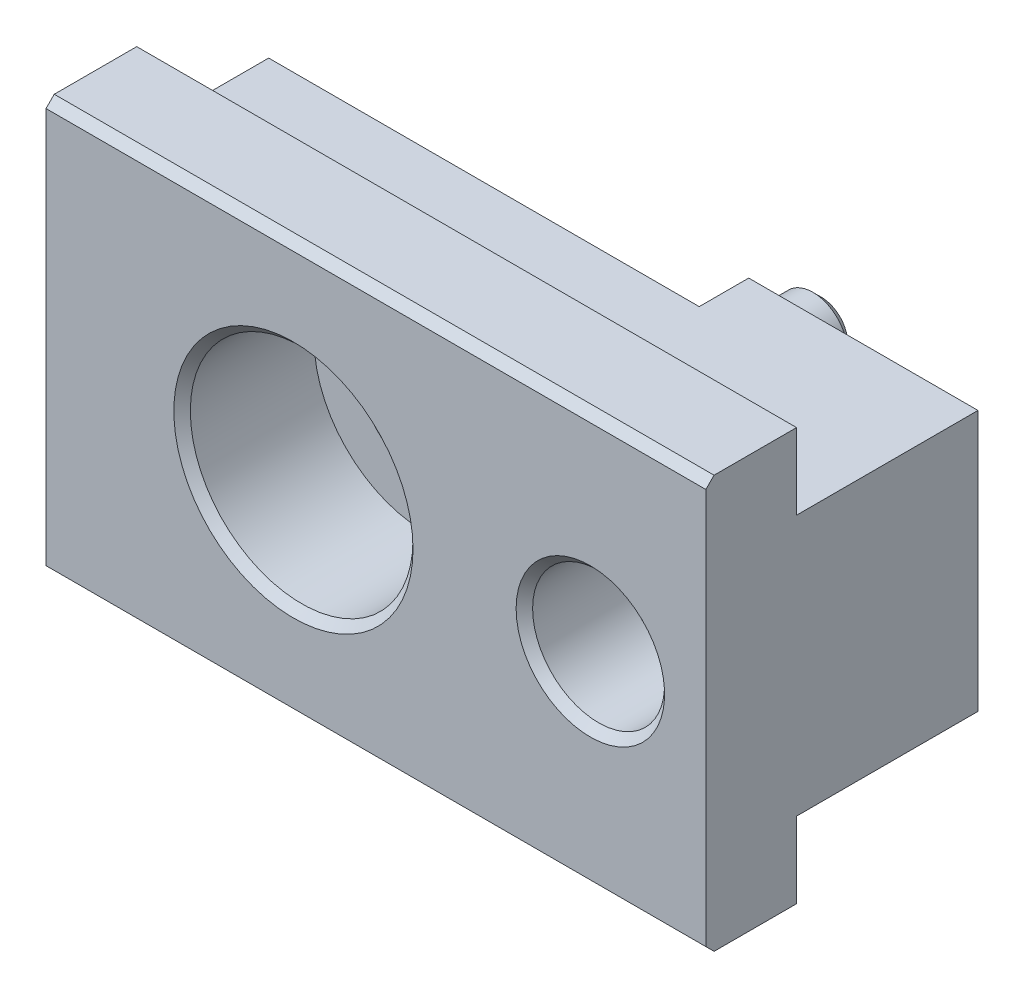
ISO-10303-21;
HEADER;
FILE_DESCRIPTION(('STEP AP214'),'2;1');
FILE_NAME('part.step','',(''),(''),'','','');
FILE_SCHEMA(('AUTOMOTIVE_DESIGN { 1 0 10303 214 1 1 1 1 }'));
ENDSEC;
DATA;
#1=APPLICATION_CONTEXT('core data for automotive mechanical design processes');
#2=APPLICATION_PROTOCOL_DEFINITION('international standard','automotive_design',2000,#1);
#3=PRODUCT_CONTEXT('',#1,'mechanical');
#4=PRODUCT('Part','Part','',(#3));
#5=PRODUCT_RELATED_PRODUCT_CATEGORY('part','',(#4));
#6=PRODUCT_DEFINITION_FORMATION('','',#4);
#7=PRODUCT_DEFINITION_CONTEXT('part definition',#1,'design');
#8=PRODUCT_DEFINITION('design','',#6,#7);
#9=PRODUCT_DEFINITION_SHAPE('','',#8);
#10=(LENGTH_UNIT() NAMED_UNIT(*) SI_UNIT(.MILLI.,.METRE.));
#11=(NAMED_UNIT(*) PLANE_ANGLE_UNIT() SI_UNIT($,.RADIAN.));
#12=(NAMED_UNIT(*) SI_UNIT($,.STERADIAN.) SOLID_ANGLE_UNIT());
#13=UNCERTAINTY_MEASURE_WITH_UNIT(LENGTH_MEASURE(1.E-05),#10,'distance_accuracy_value','');
#14=(GEOMETRIC_REPRESENTATION_CONTEXT(3) GLOBAL_UNCERTAINTY_ASSIGNED_CONTEXT((#13)) GLOBAL_UNIT_ASSIGNED_CONTEXT((#10,
#11,#12)) REPRESENTATION_CONTEXT('',''));
#15=CARTESIAN_POINT('',(0.,0.,0.));
#16=DIRECTION('',(0.,0.,1.));
#17=DIRECTION('',(1.,0.,0.));
#18=AXIS2_PLACEMENT_3D('',#15,#16,#17);
#19=CARTESIAN_POINT('',(-18.,0.,5.5000000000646));
#20=DIRECTION('',(0.,0.,-1.));
#21=DIRECTION('',(1.,0.,0.));
#22=AXIS2_PLACEMENT_3D('',#19,#20,#21);
#23=CYLINDRICAL_SURFACE('',#22,4.1);
#24=CARTESIAN_POINT('',(-18.,0.,-7.5));
#25=DIRECTION('',(0.,0.,1.));
#26=DIRECTION('',(-1.,0.,0.));
#27=AXIS2_PLACEMENT_3D('',#24,#25,#26);
#28=CIRCLE('',#27,4.1);
#29=CARTESIAN_POINT('',(-22.1,0.,-7.5));
#30=VERTEX_POINT('',#29);
#31=EDGE_CURVE('E160',#30,#30,#28,.F.);
#32=ORIENTED_EDGE('',*,*,#31,.T.);
#33=EDGE_LOOP('',(#32));
#34=FACE_BOUND('',#33,.T.);
#35=CARTESIAN_POINT('',(-18.,0.,-2.5));
#36=DIRECTION('',(0.,0.,1.));
#37=DIRECTION('',(-1.,0.,0.));
#38=AXIS2_PLACEMENT_3D('',#35,#36,#37);
#39=CIRCLE('',#38,4.1);
#40=CARTESIAN_POINT('',(-22.1,0.,-2.5));
#41=VERTEX_POINT('',#40);
#42=EDGE_CURVE('E147',#41,#41,#39,.F.);
#43=ORIENTED_EDGE('',*,*,#42,.F.);
#44=EDGE_LOOP('',(#43));
#45=FACE_BOUND('',#44,.T.);
#46=ADVANCED_FACE('F14',(#34,#45),#23,.F.);
#47=CARTESIAN_POINT('',(-7.,7.95,-11.));
#48=DIRECTION('',(0.,0.,1.));
#49=DIRECTION('',(-1.,0.,0.));
#50=AXIS2_PLACEMENT_3D('',#47,#48,#49);
#51=PLANE('',#50);
#52=CARTESIAN_POINT('',(0.,0.,-11.));
#53=DIRECTION('',(0.,0.,1.));
#54=DIRECTION('',(-1.,0.,0.));
#55=AXIS2_PLACEMENT_3D('',#52,#53,#54);
#56=CIRCLE('',#55,3.5);
#57=CARTESIAN_POINT('',(-3.5,0.,-11.));
#58=VERTEX_POINT('',#57);
#59=EDGE_CURVE('E227',#58,#58,#56,.T.);
#60=ORIENTED_EDGE('',*,*,#59,.T.);
#61=EDGE_LOOP('',(#60));
#62=FACE_BOUND('',#61,.T.);
#63=DIRECTION('',(0.,1.,0.));
#64=VECTOR('',#63,1.);
#65=CARTESIAN_POINT('',(7.,7.95,-11.));
#66=LINE('',#65,#64);
#67=CARTESIAN_POINT('',(7.,-7.9,-11.));
#68=VERTEX_POINT('',#67);
#69=CARTESIAN_POINT('',(7.,7.9,-11.));
#70=VERTEX_POINT('',#69);
#71=EDGE_CURVE('E194',#68,#70,#66,.T.);
#72=ORIENTED_EDGE('',*,*,#71,.F.);
#73=DIRECTION('',(-1.,0.,0.));
#74=VECTOR('',#73,1.);
#75=CARTESIAN_POINT('',(-7.,-7.9,-11.));
#76=LINE('',#75,#74);
#77=CARTESIAN_POINT('',(-6.9,-7.9,-11.));
#78=VERTEX_POINT('',#77);
#79=EDGE_CURVE('E130',#68,#78,#76,.T.);
#80=ORIENTED_EDGE('',*,*,#79,.T.);
#81=DIRECTION('',(0.,-1.,0.));
#82=VECTOR('',#81,1.);
#83=CARTESIAN_POINT('',(-6.9,7.95,-11.));
#84=LINE('',#83,#82);
#85=CARTESIAN_POINT('',(-6.9,7.9,-11.));
#86=VERTEX_POINT('',#85);
#87=EDGE_CURVE('E151',#86,#78,#84,.T.);
#88=ORIENTED_EDGE('',*,*,#87,.F.);
#89=DIRECTION('',(1.,0.,0.));
#90=VECTOR('',#89,1.);
#91=CARTESIAN_POINT('',(-7.,7.9,-11.));
#92=LINE('',#91,#90);
#93=EDGE_CURVE('E36',#86,#70,#92,.T.);
#94=ORIENTED_EDGE('',*,*,#93,.T.);
#95=EDGE_LOOP('',(#72,#80,#88,#94));
#96=FACE_BOUND('',#95,.T.);
#97=ADVANCED_FACE('F254',(#62,#96),#51,.F.);
#98=CARTESIAN_POINT('',(0.,0.,-0.4999999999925));
#99=DIRECTION('',(0.,0.,1.));
#100=DIRECTION('',(-1.,0.,0.));
#101=AXIS2_PLACEMENT_3D('',#98,#99,#100);
#102=CONICAL_SURFACE('',#101,3.02499999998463,1.17809724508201);
#103=CARTESIAN_POINT('',(0.,0.,-0.510355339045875));
#104=DIRECTION('',(0.,0.,1.));
#105=DIRECTION('',(-1.,0.,0.));
#106=AXIS2_PLACEMENT_3D('',#103,#104,#105);
#107=CIRCLE('',#106,3.);
#108=CARTESIAN_POINT('',(-3.,0.,-0.510355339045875));
#109=VERTEX_POINT('',#108);
#110=EDGE_CURVE('E154',#109,#109,#107,.F.);
#111=ORIENTED_EDGE('',*,*,#110,.T.);
#112=EDGE_LOOP('',(#111));
#113=FACE_BOUND('',#112,.T.);
#114=CARTESIAN_POINT('',(0.,0.,-0.499999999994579));
#115=DIRECTION('',(0.,0.,1.));
#116=DIRECTION('',(-1.,0.,0.));
#117=AXIS2_PLACEMENT_3D('',#114,#115,#116);
#118=CIRCLE('',#117,3.02499999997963);
#119=CARTESIAN_POINT('',(-3.02499999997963,0.,-0.499999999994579));
#120=VERTEX_POINT('',#119);
#121=EDGE_CURVE('E157',#120,#120,#118,.F.);
#122=ORIENTED_EDGE('',*,*,#121,.F.);
#123=EDGE_LOOP('',(#122));
#124=FACE_BOUND('',#123,.T.);
#125=ADVANCED_FACE('F305',(#113,#124),#102,.F.);
#126=CARTESIAN_POINT('',(0.,0.,-0.5));
#127=DIRECTION('',(0.,0.,1.));
#128=DIRECTION('',(-1.,0.,0.));
#129=AXIS2_PLACEMENT_3D('',#126,#127,#128);
#130=PLANE('',#129);
#131=CARTESIAN_POINT('',(0.,0.,-0.5));
#132=DIRECTION('',(0.,0.,1.));
#133=DIRECTION('',(-1.,0.,0.));
#134=AXIS2_PLACEMENT_3D('',#131,#132,#133);
#135=CIRCLE('',#134,4.);
#136=CARTESIAN_POINT('',(-4.,0.,-0.5));
#137=VERTEX_POINT('',#136);
#138=EDGE_CURVE('E208',#137,#137,#135,.T.);
#139=ORIENTED_EDGE('',*,*,#138,.T.);
#140=EDGE_LOOP('',(#139));
#141=FACE_BOUND('',#140,.T.);
#142=ORIENTED_EDGE('',*,*,#121,.T.);
#143=EDGE_LOOP('',(#142));
#144=FACE_BOUND('',#143,.T.);
#145=ADVANCED_FACE('F294',(#141,#144),#130,.T.);
#146=CARTESIAN_POINT('',(0.,0.,-0.5));
#147=DIRECTION('',(0.,0.,1.));
#148=DIRECTION('',(-1.,0.,0.));
#149=AXIS2_PLACEMENT_3D('',#146,#147,#148);
#150=CYLINDRICAL_SURFACE('',#149,4.);
#151=CARTESIAN_POINT('',(0.,0.,5.00000000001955));
#152=DIRECTION('',(0.,0.,1.));
#153=DIRECTION('',(-1.,0.,0.));
#154=AXIS2_PLACEMENT_3D('',#151,#152,#153);
#155=CIRCLE('',#154,3.99999999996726);
#156=CARTESIAN_POINT('',(-3.99999999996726,0.,5.00000000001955));
#157=VERTEX_POINT('',#156);
#158=EDGE_CURVE('E203',#157,#157,#155,.T.);
#159=ORIENTED_EDGE('',*,*,#158,.T.);
#160=EDGE_LOOP('',(#159));
#161=FACE_BOUND('',#160,.T.);
#162=ORIENTED_EDGE('',*,*,#138,.F.);
#163=EDGE_LOOP('',(#162));
#164=FACE_BOUND('',#163,.T.);
#165=ADVANCED_FACE('F285',(#161,#164),#150,.F.);
#166=CARTESIAN_POINT('',(-7.,-12.5,0.));
#167=DIRECTION('',(0.,1.,0.));
#168=DIRECTION('',(-1.,0.,0.));
#169=AXIS2_PLACEMENT_3D('',#166,#167,#168);
#170=PLANE('',#169);
#171=DIRECTION('',(-1.,0.,0.));
#172=VECTOR('',#171,1.);
#173=CARTESIAN_POINT('',(-7.,-12.5,5.));
#174=LINE('',#173,#172);
#175=CARTESIAN_POINT('',(7.,-12.5,5.));
#176=VERTEX_POINT('',#175);
#177=CARTESIAN_POINT('',(-33.,-12.5,5.));
#178=VERTEX_POINT('',#177);
#179=EDGE_CURVE('E182',#176,#178,#174,.T.);
#180=ORIENTED_EDGE('',*,*,#179,.T.);
#181=DIRECTION('',(0.,0.,1.));
#182=VECTOR('',#181,1.);
#183=CARTESIAN_POINT('',(-33.,-12.5,-11.));
#184=LINE('',#183,#182);
#185=CARTESIAN_POINT('',(-33.,-12.5,0.));
#186=VERTEX_POINT('',#185);
#187=EDGE_CURVE('E180',#186,#178,#184,.T.);
#188=ORIENTED_EDGE('',*,*,#187,.F.);
#189=DIRECTION('',(-1.,0.,0.));
#190=VECTOR('',#189,1.);
#191=CARTESIAN_POINT('',(-7.,-12.5,0.));
#192=LINE('',#191,#190);
#193=CARTESIAN_POINT('',(7.,-12.5,0.));
#194=VERTEX_POINT('',#193);
#195=EDGE_CURVE('E109',#186,#194,#192,.F.);
#196=ORIENTED_EDGE('',*,*,#195,.T.);
#197=DIRECTION('',(0.,0.,1.));
#198=VECTOR('',#197,1.);
#199=CARTESIAN_POINT('',(7.,-12.5,-11.));
#200=LINE('',#199,#198);
#201=EDGE_CURVE('E198',#176,#194,#200,.F.);
#202=ORIENTED_EDGE('',*,*,#201,.F.);
#203=EDGE_LOOP('',(#180,#188,#196,#202));
#204=FACE_BOUND('',#203,.T.);
#205=ADVANCED_FACE('F283',(#204),#170,.F.);
#206=CARTESIAN_POINT('',(-7.,12.5,0.));
#207=DIRECTION('',(0.,-1.,0.));
#208=DIRECTION('',(1.,0.,0.));
#209=AXIS2_PLACEMENT_3D('',#206,#207,#208);
#210=PLANE('',#209);
#211=DIRECTION('',(-1.,0.,0.));
#212=VECTOR('',#211,1.);
#213=CARTESIAN_POINT('',(-7.,12.5,5.));
#214=LINE('',#213,#212);
#215=CARTESIAN_POINT('',(-33.,12.5,5.));
#216=VERTEX_POINT('',#215);
#217=CARTESIAN_POINT('',(7.,12.5,5.));
#218=VERTEX_POINT('',#217);
#219=EDGE_CURVE('E200',#216,#218,#214,.F.);
#220=ORIENTED_EDGE('',*,*,#219,.T.);
#221=DIRECTION('',(0.,0.,1.));
#222=VECTOR('',#221,1.);
#223=CARTESIAN_POINT('',(7.,12.5,-11.));
#224=LINE('',#223,#222);
#225=CARTESIAN_POINT('',(7.,12.5,0.));
#226=VERTEX_POINT('',#225);
#227=EDGE_CURVE('E190',#226,#218,#224,.T.);
#228=ORIENTED_EDGE('',*,*,#227,.F.);
#229=DIRECTION('',(-1.,0.,0.));
#230=VECTOR('',#229,1.);
#231=CARTESIAN_POINT('',(-7.,12.5,0.));
#232=LINE('',#231,#230);
#233=CARTESIAN_POINT('',(-33.,12.5,0.));
#234=VERTEX_POINT('',#233);
#235=EDGE_CURVE('E205',#226,#234,#232,.T.);
#236=ORIENTED_EDGE('',*,*,#235,.T.);
#237=DIRECTION('',(0.,0.,1.));
#238=VECTOR('',#237,1.);
#239=CARTESIAN_POINT('',(-33.,12.5,-11.));
#240=LINE('',#239,#238);
#241=EDGE_CURVE('E173',#216,#234,#240,.F.);
#242=ORIENTED_EDGE('',*,*,#241,.F.);
#243=EDGE_LOOP('',(#220,#228,#236,#242));
#244=FACE_BOUND('',#243,.T.);
#245=ADVANCED_FACE('F268',(#244),#210,.F.);
#246=CARTESIAN_POINT('',(-7.,12.5,0.));
#247=DIRECTION('',(0.,0.,1.));
#248=DIRECTION('',(-1.,0.,0.));
#249=AXIS2_PLACEMENT_3D('',#246,#247,#248);
#250=PLANE('',#249);
#251=ORIENTED_EDGE('',*,*,#235,.F.);
#252=DIRECTION('',(0.,1.,0.));
#253=VECTOR('',#252,1.);
#254=CARTESIAN_POINT('',(7.,7.95,0.));
#255=LINE('',#254,#253);
#256=CARTESIAN_POINT('',(7.,7.9,0.));
#257=VERTEX_POINT('',#256);
#258=EDGE_CURVE('E192',#257,#226,#255,.T.);
#259=ORIENTED_EDGE('',*,*,#258,.F.);
#260=DIRECTION('',(1.,0.,0.));
#261=VECTOR('',#260,1.);
#262=CARTESIAN_POINT('',(-33.,7.9,0.));
#263=LINE('',#262,#261);
#264=CARTESIAN_POINT('',(-33.,7.9,0.));
#265=VERTEX_POINT('',#264);
#266=EDGE_CURVE('E136',#265,#257,#263,.T.);
#267=ORIENTED_EDGE('',*,*,#266,.F.);
#268=DIRECTION('',(0.,-1.,0.));
#269=VECTOR('',#268,1.);
#270=CARTESIAN_POINT('',(-33.,7.95,0.));
#271=LINE('',#270,#269);
#272=EDGE_CURVE('E171',#234,#265,#271,.T.);
#273=ORIENTED_EDGE('',*,*,#272,.F.);
#274=EDGE_LOOP('',(#251,#259,#267,#273));
#275=FACE_BOUND('',#274,.T.);
#276=ADVANCED_FACE('F262',(#275),#250,.F.);
#277=CARTESIAN_POINT('',(-33.,7.95,-8.));
#278=DIRECTION('',(0.,0.,1.));
#279=DIRECTION('',(-1.,0.,0.));
#280=AXIS2_PLACEMENT_3D('',#277,#278,#279);
#281=PLANE('',#280);
#282=CARTESIAN_POINT('',(-10.,0.,-8.));
#283=DIRECTION('',(0.,0.,1.));
#284=DIRECTION('',(-1.,0.,0.));
#285=AXIS2_PLACEMENT_3D('',#282,#283,#284);
#286=CIRCLE('',#285,2.1);
#287=CARTESIAN_POINT('',(-12.1,0.,-8.));
#288=VERTEX_POINT('',#287);
#289=EDGE_CURVE('E236',#288,#288,#286,.F.);
#290=ORIENTED_EDGE('',*,*,#289,.F.);
#291=EDGE_LOOP('',(#290));
#292=FACE_BOUND('',#291,.T.);
#293=CARTESIAN_POINT('',(-18.,0.,-8.));
#294=DIRECTION('',(0.,0.,1.));
#295=DIRECTION('',(-1.,0.,0.));
#296=AXIS2_PLACEMENT_3D('',#293,#294,#295);
#297=CIRCLE('',#296,4.6);
#298=CARTESIAN_POINT('',(-22.6,0.,-8.));
#299=VERTEX_POINT('',#298);
#300=EDGE_CURVE('E221',#299,#299,#297,.T.);
#301=ORIENTED_EDGE('',*,*,#300,.T.);
#302=EDGE_LOOP('',(#301));
#303=FACE_BOUND('',#302,.T.);
#304=DIRECTION('',(0.,-1.,0.));
#305=VECTOR('',#304,1.);
#306=CARTESIAN_POINT('',(-6.9,15.2118891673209,-8.));
#307=LINE('',#306,#305);
#308=CARTESIAN_POINT('',(-6.9,7.9,-8.));
#309=VERTEX_POINT('',#308);
#310=CARTESIAN_POINT('',(-6.9,-7.9,-8.));
#311=VERTEX_POINT('',#310);
#312=EDGE_CURVE('E148',#309,#311,#307,.T.);
#313=ORIENTED_EDGE('',*,*,#312,.T.);
#314=DIRECTION('',(-1.,0.,0.));
#315=VECTOR('',#314,1.);
#316=CARTESIAN_POINT('',(-33.,-7.9,-8.));
#317=LINE('',#316,#315);
#318=CARTESIAN_POINT('',(-33.,-7.9,-8.));
#319=VERTEX_POINT('',#318);
#320=EDGE_CURVE('E28',#311,#319,#317,.T.);
#321=ORIENTED_EDGE('',*,*,#320,.T.);
#322=DIRECTION('',(0.,-1.,0.));
#323=VECTOR('',#322,1.);
#324=CARTESIAN_POINT('',(-33.,7.95,-8.));
#325=LINE('',#324,#323);
#326=CARTESIAN_POINT('',(-33.,7.9,-8.));
#327=VERTEX_POINT('',#326);
#328=EDGE_CURVE('E114',#327,#319,#325,.T.);
#329=ORIENTED_EDGE('',*,*,#328,.F.);
#330=DIRECTION('',(1.,0.,0.));
#331=VECTOR('',#330,1.);
#332=CARTESIAN_POINT('',(-33.,7.9,-8.));
#333=LINE('',#332,#331);
#334=EDGE_CURVE('E140',#327,#309,#333,.T.);
#335=ORIENTED_EDGE('',*,*,#334,.T.);
#336=EDGE_LOOP('',(#313,#321,#329,#335));
#337=FACE_BOUND('',#336,.T.);
#338=ADVANCED_FACE('F250',(#292,#303,#337),#281,.F.);
#339=CARTESIAN_POINT('',(-7.,-7.95,0.));
#340=DIRECTION('',(0.,0.,1.));
#341=DIRECTION('',(-1.,0.,0.));
#342=AXIS2_PLACEMENT_3D('',#339,#340,#341);
#343=PLANE('',#342);
#344=ORIENTED_EDGE('',*,*,#195,.F.);
#345=DIRECTION('',(0.,-1.,0.));
#346=VECTOR('',#345,1.);
#347=CARTESIAN_POINT('',(-33.,7.95,0.));
#348=LINE('',#347,#346);
#349=CARTESIAN_POINT('',(-33.,-7.9,0.));
#350=VERTEX_POINT('',#349);
#351=EDGE_CURVE('E103',#350,#186,#348,.T.);
#352=ORIENTED_EDGE('',*,*,#351,.F.);
#353=DIRECTION('',(1.,0.,0.));
#354=VECTOR('',#353,1.);
#355=CARTESIAN_POINT('',(-33.,-7.9,0.));
#356=LINE('',#355,#354);
#357=CARTESIAN_POINT('',(7.,-7.9,0.));
#358=VERTEX_POINT('',#357);
#359=EDGE_CURVE('E107',#350,#358,#356,.T.);
#360=ORIENTED_EDGE('',*,*,#359,.T.);
#361=DIRECTION('',(0.,1.,0.));
#362=VECTOR('',#361,1.);
#363=CARTESIAN_POINT('',(7.,7.95,0.));
#364=LINE('',#363,#362);
#365=EDGE_CURVE('E196',#194,#358,#364,.T.);
#366=ORIENTED_EDGE('',*,*,#365,.F.);
#367=EDGE_LOOP('',(#344,#352,#360,#366));
#368=FACE_BOUND('',#367,.T.);
#369=ADVANCED_FACE('F105',(#368),#343,.F.);
#370=CARTESIAN_POINT('',(0.,0.,5.5000000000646));
#371=DIRECTION('',(0.,0.,1.));
#372=DIRECTION('',(-1.,0.,0.));
#373=AXIS2_PLACEMENT_3D('',#370,#371,#372);
#374=CONICAL_SURFACE('',#373,4.49999999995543,0.785398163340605);
#375=CARTESIAN_POINT('',(0.,0.,5.5000000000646));
#376=DIRECTION('',(0.,0.,1.));
#377=DIRECTION('',(-1.,0.,0.));
#378=AXIS2_PLACEMENT_3D('',#375,#376,#377);
#379=CIRCLE('',#378,4.49999999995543);
#380=CARTESIAN_POINT('',(-4.49999999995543,0.,5.5000000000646));
#381=VERTEX_POINT('',#380);
#382=EDGE_CURVE('E113',#381,#381,#379,.T.);
#383=ORIENTED_EDGE('',*,*,#382,.T.);
#384=EDGE_LOOP('',(#383));
#385=FACE_BOUND('',#384,.T.);
#386=ORIENTED_EDGE('',*,*,#158,.F.);
#387=EDGE_LOOP('',(#386));
#388=FACE_BOUND('',#387,.T.);
#389=ADVANCED_FACE('F330',(#385,#388),#374,.F.);
#390=CARTESIAN_POINT('',(-7.,12.5,5.));
#391=DIRECTION('',(0.,-0.707106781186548,-0.707106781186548));
#392=DIRECTION('',(0.,-0.707106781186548,0.707106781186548));
#393=AXIS2_PLACEMENT_3D('',#390,#391,#392);
#394=PLANE('',#393);
#395=DIRECTION('',(1.,0.,0.));
#396=VECTOR('',#395,1.);
#397=CARTESIAN_POINT('',(-7.,12.,5.5));
#398=LINE('',#397,#396);
#399=CARTESIAN_POINT('',(-33.,12.,5.5));
#400=VERTEX_POINT('',#399);
#401=CARTESIAN_POINT('',(7.,12.,5.5));
#402=VERTEX_POINT('',#401);
#403=EDGE_CURVE('E167',#400,#402,#398,.T.);
#404=ORIENTED_EDGE('',*,*,#403,.T.);
#405=DIRECTION('',(0.,-0.707106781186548,0.707106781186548));
#406=VECTOR('',#405,1.);
#407=CARTESIAN_POINT('',(7.,12.5,5.));
#408=LINE('',#407,#406);
#409=EDGE_CURVE('E188',#218,#402,#408,.T.);
#410=ORIENTED_EDGE('',*,*,#409,.F.);
#411=ORIENTED_EDGE('',*,*,#219,.F.);
#412=DIRECTION('',(0.,0.707106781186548,-0.707106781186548));
#413=VECTOR('',#412,1.);
#414=CARTESIAN_POINT('',(-33.,12.,5.5));
#415=LINE('',#414,#413);
#416=EDGE_CURVE('E175',#400,#216,#415,.T.);
#417=ORIENTED_EDGE('',*,*,#416,.F.);
#418=EDGE_LOOP('',(#404,#410,#411,#417));
#419=FACE_BOUND('',#418,.T.);
#420=ADVANCED_FACE('F271',(#419),#394,.F.);
#421=CARTESIAN_POINT('',(7.,7.95,-11.));
#422=DIRECTION('',(1.,0.,0.));
#423=DIRECTION('',(0.,1.,0.));
#424=AXIS2_PLACEMENT_3D('',#421,#422,#423);
#425=PLANE('',#424);
#426=ORIENTED_EDGE('',*,*,#365,.T.);
#427=DIRECTION('',(0.,0.,1.));
#428=VECTOR('',#427,1.);
#429=CARTESIAN_POINT('',(7.,-7.9,0.));
#430=LINE('',#429,#428);
#431=EDGE_CURVE('E120',#68,#358,#430,.T.);
#432=ORIENTED_EDGE('',*,*,#431,.F.);
#433=ORIENTED_EDGE('',*,*,#71,.T.);
#434=DIRECTION('',(0.,0.,-1.));
#435=VECTOR('',#434,1.);
#436=CARTESIAN_POINT('',(7.,7.9,0.));
#437=LINE('',#436,#435);
#438=EDGE_CURVE('E133',#257,#70,#437,.T.);
#439=ORIENTED_EDGE('',*,*,#438,.F.);
#440=ORIENTED_EDGE('',*,*,#258,.T.);
#441=ORIENTED_EDGE('',*,*,#227,.T.);
#442=ORIENTED_EDGE('',*,*,#409,.T.);
#443=DIRECTION('',(0.,-1.,0.));
#444=VECTOR('',#443,1.);
#445=CARTESIAN_POINT('',(7.,12.5,5.5));
#446=LINE('',#445,#444);
#447=CARTESIAN_POINT('',(7.,-12.,5.5));
#448=VERTEX_POINT('',#447);
#449=EDGE_CURVE('E164',#402,#448,#446,.T.);
#450=ORIENTED_EDGE('',*,*,#449,.T.);
#451=DIRECTION('',(0.,-0.707106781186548,-0.707106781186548));
#452=VECTOR('',#451,1.);
#453=CARTESIAN_POINT('',(7.,-12.,5.5));
#454=LINE('',#453,#452);
#455=EDGE_CURVE('E185',#448,#176,#454,.T.);
#456=ORIENTED_EDGE('',*,*,#455,.T.);
#457=ORIENTED_EDGE('',*,*,#201,.T.);
#458=EDGE_LOOP('',(#426,#432,#433,#439,#440,#441,#442,#450,#456,#457));
#459=FACE_BOUND('',#458,.T.);
#460=ADVANCED_FACE('F257',(#459),#425,.T.);
#461=CARTESIAN_POINT('',(-7.,-12.,5.5));
#462=DIRECTION('',(0.,0.707106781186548,-0.707106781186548));
#463=DIRECTION('',(0.,-0.707106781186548,-0.707106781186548));
#464=AXIS2_PLACEMENT_3D('',#461,#462,#463);
#465=PLANE('',#464);
#466=ORIENTED_EDGE('',*,*,#179,.F.);
#467=ORIENTED_EDGE('',*,*,#455,.F.);
#468=DIRECTION('',(1.,0.,0.));
#469=VECTOR('',#468,1.);
#470=CARTESIAN_POINT('',(-7.,-12.,5.5));
#471=LINE('',#470,#469);
#472=CARTESIAN_POINT('',(-33.,-12.,5.5));
#473=VERTEX_POINT('',#472);
#474=EDGE_CURVE('E161',#448,#473,#471,.F.);
#475=ORIENTED_EDGE('',*,*,#474,.T.);
#476=DIRECTION('',(0.,0.707106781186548,0.707106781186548));
#477=VECTOR('',#476,1.);
#478=CARTESIAN_POINT('',(-33.,-12.5,5.));
#479=LINE('',#478,#477);
#480=EDGE_CURVE('E178',#178,#473,#479,.T.);
#481=ORIENTED_EDGE('',*,*,#480,.F.);
#482=EDGE_LOOP('',(#466,#467,#475,#481));
#483=FACE_BOUND('',#482,.T.);
#484=ADVANCED_FACE('F280',(#483),#465,.F.);
#485=CARTESIAN_POINT('',(-33.,7.95,-11.));
#486=DIRECTION('',(-1.,0.,0.));
#487=DIRECTION('',(0.,-1.,0.));
#488=AXIS2_PLACEMENT_3D('',#485,#486,#487);
#489=PLANE('',#488);
#490=DIRECTION('',(0.,0.,1.));
#491=VECTOR('',#490,1.);
#492=CARTESIAN_POINT('',(-33.,-7.9,0.));
#493=LINE('',#492,#491);
#494=EDGE_CURVE('E118',#319,#350,#493,.T.);
#495=ORIENTED_EDGE('',*,*,#494,.T.);
#496=ORIENTED_EDGE('',*,*,#351,.T.);
#497=ORIENTED_EDGE('',*,*,#187,.T.);
#498=ORIENTED_EDGE('',*,*,#480,.T.);
#499=DIRECTION('',(0.,-1.,0.));
#500=VECTOR('',#499,1.);
#501=CARTESIAN_POINT('',(-33.,12.5,5.5));
#502=LINE('',#501,#500);
#503=EDGE_CURVE('E158',#473,#400,#502,.F.);
#504=ORIENTED_EDGE('',*,*,#503,.T.);
#505=ORIENTED_EDGE('',*,*,#416,.T.);
#506=ORIENTED_EDGE('',*,*,#241,.T.);
#507=ORIENTED_EDGE('',*,*,#272,.T.);
#508=DIRECTION('',(0.,0.,-1.));
#509=VECTOR('',#508,1.);
#510=CARTESIAN_POINT('',(-33.,7.9,0.));
#511=LINE('',#510,#509);
#512=EDGE_CURVE('E134',#265,#327,#511,.T.);
#513=ORIENTED_EDGE('',*,*,#512,.T.);
#514=ORIENTED_EDGE('',*,*,#328,.T.);
#515=EDGE_LOOP('',(#495,#496,#497,#498,#504,#505,#506,#507,#513,#514));
#516=FACE_BOUND('',#515,.T.);
#517=ADVANCED_FACE('F123',(#516),#489,.T.);
#518=CARTESIAN_POINT('',(-7.,12.5,5.5));
#519=DIRECTION('',(0.,0.,-1.));
#520=DIRECTION('',(1.,0.,0.));
#521=AXIS2_PLACEMENT_3D('',#518,#519,#520);
#522=PLANE('',#521);
#523=CARTESIAN_POINT('',(-18.,0.,5.5));
#524=DIRECTION('',(0.,0.,-1.));
#525=DIRECTION('',(1.,0.,0.));
#526=AXIS2_PLACEMENT_3D('',#523,#524,#525);
#527=CIRCLE('',#526,7.25);
#528=CARTESIAN_POINT('',(-10.75,0.,5.5));
#529=VERTEX_POINT('',#528);
#530=EDGE_CURVE('E233',#529,#529,#527,.T.);
#531=ORIENTED_EDGE('',*,*,#530,.T.);
#532=EDGE_LOOP('',(#531));
#533=FACE_BOUND('',#532,.T.);
#534=ORIENTED_EDGE('',*,*,#403,.F.);
#535=ORIENTED_EDGE('',*,*,#503,.F.);
#536=ORIENTED_EDGE('',*,*,#474,.F.);
#537=ORIENTED_EDGE('',*,*,#449,.F.);
#538=EDGE_LOOP('',(#534,#535,#536,#537));
#539=FACE_BOUND('',#538,.T.);
#540=ORIENTED_EDGE('',*,*,#382,.F.);
#541=EDGE_LOOP('',(#540));
#542=FACE_BOUND('',#541,.T.);
#543=ADVANCED_FACE('F275',(#533,#539,#542),#522,.F.);
#544=CARTESIAN_POINT('',(0.,0.,5.5000000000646));
#545=DIRECTION('',(0.,0.,-1.));
#546=DIRECTION('',(1.,0.,0.));
#547=AXIS2_PLACEMENT_3D('',#544,#545,#546);
#548=CYLINDRICAL_SURFACE('',#547,3.);
#549=CARTESIAN_POINT('',(0.,0.,-10.5));
#550=DIRECTION('',(0.,0.,1.));
#551=DIRECTION('',(-1.,0.,0.));
#552=AXIS2_PLACEMENT_3D('',#549,#550,#551);
#553=CIRCLE('',#552,3.);
#554=CARTESIAN_POINT('',(-3.,0.,-10.5));
#555=VERTEX_POINT('',#554);
#556=EDGE_CURVE('E224',#555,#555,#553,.F.);
#557=ORIENTED_EDGE('',*,*,#556,.T.);
#558=EDGE_LOOP('',(#557));
#559=FACE_BOUND('',#558,.T.);
#560=ORIENTED_EDGE('',*,*,#110,.F.);
#561=EDGE_LOOP('',(#560));
#562=FACE_BOUND('',#561,.T.);
#563=ADVANCED_FACE('F315',(#559,#562),#548,.F.);
#564=CARTESIAN_POINT('',(-6.9,15.2118891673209,-18.5016554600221));
#565=DIRECTION('',(-1.,0.,0.));
#566=DIRECTION('',(0.,-1.,0.));
#567=AXIS2_PLACEMENT_3D('',#564,#565,#566);
#568=PLANE('',#567);
#569=DIRECTION('',(0.,0.,-1.));
#570=VECTOR('',#569,1.);
#571=CARTESIAN_POINT('',(-6.9,-7.9,-18.5016554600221));
#572=LINE('',#571,#570);
#573=EDGE_CURVE('E9',#311,#78,#572,.T.);
#574=ORIENTED_EDGE('',*,*,#573,.F.);
#575=ORIENTED_EDGE('',*,*,#312,.F.);
#576=DIRECTION('',(0.,0.,1.));
#577=VECTOR('',#576,1.);
#578=CARTESIAN_POINT('',(-6.9,7.9,-18.5016554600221));
#579=LINE('',#578,#577);
#580=EDGE_CURVE('E22',#86,#309,#579,.T.);
#581=ORIENTED_EDGE('',*,*,#580,.F.);
#582=ORIENTED_EDGE('',*,*,#87,.T.);
#583=EDGE_LOOP('',(#574,#575,#581,#582));
#584=FACE_BOUND('',#583,.T.);
#585=ADVANCED_FACE('F251',(#584),#568,.T.);
#586=CARTESIAN_POINT('',(-18.,0.,-2.5));
#587=DIRECTION('',(0.,0.,1.));
#588=DIRECTION('',(-1.,0.,0.));
#589=AXIS2_PLACEMENT_3D('',#586,#587,#588);
#590=PLANE('',#589);
#591=CARTESIAN_POINT('',(-18.,0.,-2.5));
#592=DIRECTION('',(0.,0.,1.));
#593=DIRECTION('',(-1.,0.,0.));
#594=AXIS2_PLACEMENT_3D('',#591,#592,#593);
#595=CIRCLE('',#594,6.75);
#596=CARTESIAN_POINT('',(-24.75,0.,-2.5));
#597=VERTEX_POINT('',#596);
#598=EDGE_CURVE('E144',#597,#597,#595,.T.);
#599=ORIENTED_EDGE('',*,*,#598,.T.);
#600=EDGE_LOOP('',(#599));
#601=FACE_BOUND('',#600,.T.);
#602=ORIENTED_EDGE('',*,*,#42,.T.);
#603=EDGE_LOOP('',(#602));
#604=FACE_BOUND('',#603,.T.);
#605=ADVANCED_FACE('F314',(#601,#604),#590,.T.);
#606=CARTESIAN_POINT('',(-18.,0.,-2.5));
#607=DIRECTION('',(0.,0.,1.));
#608=DIRECTION('',(-1.,0.,0.));
#609=AXIS2_PLACEMENT_3D('',#606,#607,#608);
#610=CYLINDRICAL_SURFACE('',#609,6.75);
#611=CARTESIAN_POINT('',(-18.,0.,5.));
#612=DIRECTION('',(0.,0.,-1.));
#613=DIRECTION('',(1.,0.,0.));
#614=AXIS2_PLACEMENT_3D('',#611,#612,#613);
#615=CIRCLE('',#614,6.75);
#616=CARTESIAN_POINT('',(-11.25,0.,5.));
#617=VERTEX_POINT('',#616);
#618=EDGE_CURVE('E230',#617,#617,#615,.F.);
#619=ORIENTED_EDGE('',*,*,#618,.T.);
#620=EDGE_LOOP('',(#619));
#621=FACE_BOUND('',#620,.T.);
#622=ORIENTED_EDGE('',*,*,#598,.F.);
#623=EDGE_LOOP('',(#622));
#624=FACE_BOUND('',#623,.T.);
#625=ADVANCED_FACE('F310',(#621,#624),#610,.F.);
#626=CARTESIAN_POINT('',(-18.,0.,-7.5));
#627=DIRECTION('',(0.,0.,-1.));
#628=DIRECTION('',(1.,0.,0.));
#629=AXIS2_PLACEMENT_3D('',#626,#627,#628);
#630=CONICAL_SURFACE('',#629,4.1,0.785398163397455);
#631=ORIENTED_EDGE('',*,*,#300,.F.);
#632=EDGE_LOOP('',(#631));
#633=FACE_BOUND('',#632,.T.);
#634=ORIENTED_EDGE('',*,*,#31,.F.);
#635=EDGE_LOOP('',(#634));
#636=FACE_BOUND('',#635,.T.);
#637=ADVANCED_FACE('F413',(#633,#636),#630,.F.);
#638=CARTESIAN_POINT('',(0.,0.,-10.5));
#639=DIRECTION('',(0.,0.,-1.));
#640=DIRECTION('',(1.,0.,0.));
#641=AXIS2_PLACEMENT_3D('',#638,#639,#640);
#642=CONICAL_SURFACE('',#641,3.,0.785398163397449);
#643=ORIENTED_EDGE('',*,*,#59,.F.);
#644=EDGE_LOOP('',(#643));
#645=FACE_BOUND('',#644,.T.);
#646=ORIENTED_EDGE('',*,*,#556,.F.);
#647=EDGE_LOOP('',(#646));
#648=FACE_BOUND('',#647,.T.);
#649=ADVANCED_FACE('F421',(#645,#648),#642,.F.);
#650=CARTESIAN_POINT('',(-18.,0.,5.));
#651=DIRECTION('',(0.,0.,1.));
#652=DIRECTION('',(-1.,0.,0.));
#653=AXIS2_PLACEMENT_3D('',#650,#651,#652);
#654=CONICAL_SURFACE('',#653,6.75,0.785398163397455);
#655=ORIENTED_EDGE('',*,*,#530,.F.);
#656=EDGE_LOOP('',(#655));
#657=FACE_BOUND('',#656,.T.);
#658=ORIENTED_EDGE('',*,*,#618,.F.);
#659=EDGE_LOOP('',(#658));
#660=FACE_BOUND('',#659,.T.);
#661=ADVANCED_FACE('F430',(#657,#660),#654,.F.);
#662=CARTESIAN_POINT('',(-10.,0.,-18.5));
#663=DIRECTION('',(0.,0.,1.));
#664=DIRECTION('',(-1.,0.,0.));
#665=AXIS2_PLACEMENT_3D('',#662,#663,#664);
#666=CYLINDRICAL_SURFACE('',#665,2.1);
#667=CARTESIAN_POINT('',(-10.,0.,-18.));
#668=DIRECTION('',(0.,0.,-1.));
#669=DIRECTION('',(1.,0.,0.));
#670=AXIS2_PLACEMENT_3D('',#667,#668,#669);
#671=CIRCLE('',#670,2.1);
#672=CARTESIAN_POINT('',(-7.9,0.,-18.));
#673=VERTEX_POINT('',#672);
#674=EDGE_CURVE('E242',#673,#673,#671,.F.);
#675=ORIENTED_EDGE('',*,*,#674,.T.);
#676=EDGE_LOOP('',(#675));
#677=FACE_BOUND('',#676,.T.);
#678=ORIENTED_EDGE('',*,*,#289,.T.);
#679=EDGE_LOOP('',(#678));
#680=FACE_BOUND('',#679,.T.);
#681=ADVANCED_FACE('F439',(#677,#680),#666,.T.);
#682=CARTESIAN_POINT('',(-10.,0.,-18.5));
#683=DIRECTION('',(0.,0.,-1.));
#684=DIRECTION('',(1.,0.,0.));
#685=AXIS2_PLACEMENT_3D('',#682,#683,#684);
#686=PLANE('',#685);
#687=CARTESIAN_POINT('',(-10.,0.,-18.5));
#688=DIRECTION('',(0.,0.,-1.));
#689=DIRECTION('',(1.,0.,0.));
#690=AXIS2_PLACEMENT_3D('',#687,#688,#689);
#691=CIRCLE('',#690,1.60000000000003);
#692=CARTESIAN_POINT('',(-8.39999999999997,0.,-18.5));
#693=VERTEX_POINT('',#692);
#694=EDGE_CURVE('E239',#693,#693,#691,.T.);
#695=ORIENTED_EDGE('',*,*,#694,.T.);
#696=EDGE_LOOP('',(#695));
#697=FACE_BOUND('',#696,.T.);
#698=ADVANCED_FACE('F447',(#697),#686,.T.);
#699=CARTESIAN_POINT('',(-10.,0.,-18.5));
#700=DIRECTION('',(0.,0.,1.));
#701=DIRECTION('',(-1.,0.,0.));
#702=AXIS2_PLACEMENT_3D('',#699,#700,#701);
#703=CONICAL_SURFACE('',#702,1.60000000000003,0.785398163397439);
#704=ORIENTED_EDGE('',*,*,#674,.F.);
#705=EDGE_LOOP('',(#704));
#706=FACE_BOUND('',#705,.T.);
#707=ORIENTED_EDGE('',*,*,#694,.F.);
#708=EDGE_LOOP('',(#707));
#709=FACE_BOUND('',#708,.T.);
#710=ADVANCED_FACE('F16',(#706,#709),#703,.T.);
#711=CARTESIAN_POINT('',(-33.,7.9,0.));
#712=DIRECTION('',(0.,-1.,0.));
#713=DIRECTION('',(1.,0.,0.));
#714=AXIS2_PLACEMENT_3D('',#711,#712,#713);
#715=PLANE('',#714);
#716=ORIENTED_EDGE('',*,*,#580,.T.);
#717=ORIENTED_EDGE('',*,*,#334,.F.);
#718=ORIENTED_EDGE('',*,*,#512,.F.);
#719=ORIENTED_EDGE('',*,*,#266,.T.);
#720=ORIENTED_EDGE('',*,*,#438,.T.);
#721=ORIENTED_EDGE('',*,*,#93,.F.);
#722=EDGE_LOOP('',(#716,#717,#718,#719,#720,#721));
#723=FACE_BOUND('',#722,.T.);
#724=ADVANCED_FACE('F244',(#723),#715,.F.);
#725=CARTESIAN_POINT('',(-33.,-7.9,0.));
#726=DIRECTION('',(0.,1.,0.));
#727=DIRECTION('',(-1.,0.,0.));
#728=AXIS2_PLACEMENT_3D('',#725,#726,#727);
#729=PLANE('',#728);
#730=ORIENTED_EDGE('',*,*,#431,.T.);
#731=ORIENTED_EDGE('',*,*,#359,.F.);
#732=ORIENTED_EDGE('',*,*,#494,.F.);
#733=ORIENTED_EDGE('',*,*,#320,.F.);
#734=ORIENTED_EDGE('',*,*,#573,.T.);
#735=ORIENTED_EDGE('',*,*,#79,.F.);
#736=EDGE_LOOP('',(#730,#731,#732,#733,#734,#735));
#737=FACE_BOUND('',#736,.T.);
#738=ADVANCED_FACE('F117',(#737),#729,.F.);
#739=CLOSED_SHELL('',(#46,#97,#125,#145,#165,#205,#245,#276,#338,#369,#389,#420,#460,#484,#517,
#543,#563,#585,#605,#625,#637,#649,#661,#681,#698,#710,#724,#738));
#740=MANIFOLD_SOLID_BREP('B1',#739);
#741=ADVANCED_BREP_SHAPE_REPRESENTATION('',(#18,#740),#14);
#742=SHAPE_DEFINITION_REPRESENTATION(#9,#741);
ENDSEC;
END-ISO-10303-21;
